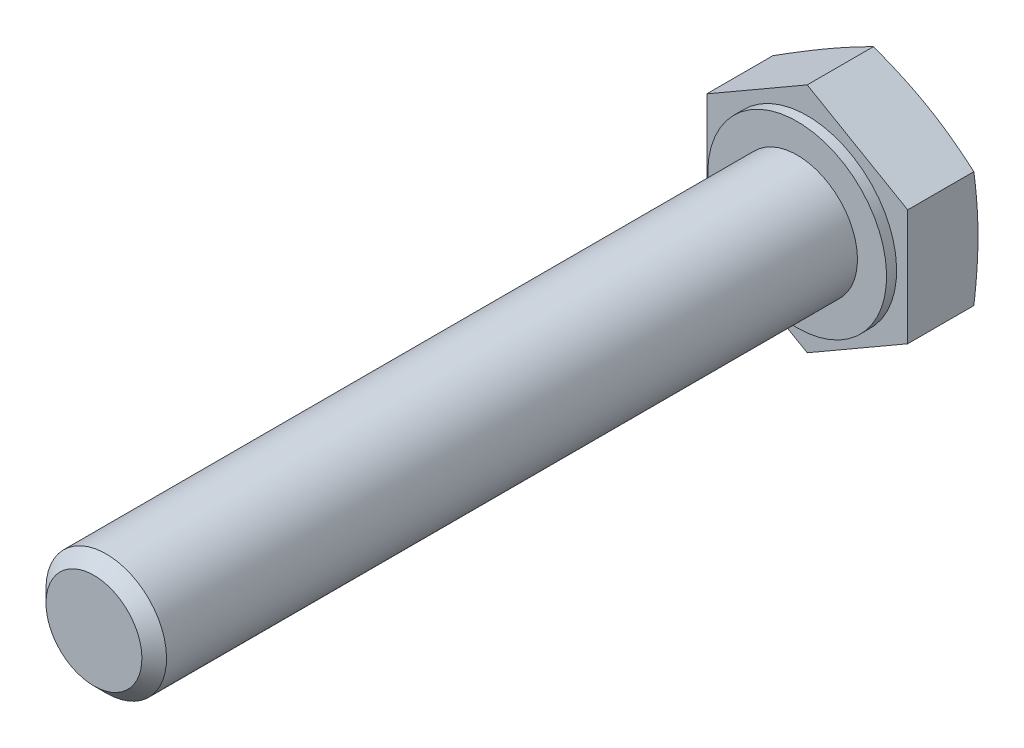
ISO-10303-21;
HEADER;
FILE_DESCRIPTION(('STEP AP214'),'2;1');
FILE_NAME('part.step','',(''),(''),'','','');
FILE_SCHEMA(('AUTOMOTIVE_DESIGN { 1 0 10303 214 1 1 1 1 }'));
ENDSEC;
DATA;
#1=APPLICATION_CONTEXT('core data for automotive mechanical design processes');
#2=APPLICATION_PROTOCOL_DEFINITION('international standard','automotive_design',2000,#1);
#3=PRODUCT_CONTEXT('',#1,'mechanical');
#4=PRODUCT('Part','Part','',(#3));
#5=PRODUCT_RELATED_PRODUCT_CATEGORY('part','',(#4));
#6=PRODUCT_DEFINITION_FORMATION('','',#4);
#7=PRODUCT_DEFINITION_CONTEXT('part definition',#1,'design');
#8=PRODUCT_DEFINITION('design','',#6,#7);
#9=PRODUCT_DEFINITION_SHAPE('','',#8);
#10=(LENGTH_UNIT() NAMED_UNIT(*) SI_UNIT(.MILLI.,.METRE.));
#11=(NAMED_UNIT(*) PLANE_ANGLE_UNIT() SI_UNIT($,.RADIAN.));
#12=(NAMED_UNIT(*) SI_UNIT($,.STERADIAN.) SOLID_ANGLE_UNIT());
#13=UNCERTAINTY_MEASURE_WITH_UNIT(LENGTH_MEASURE(1.E-05),#10,'distance_accuracy_value','');
#14=(GEOMETRIC_REPRESENTATION_CONTEXT(3) GLOBAL_UNCERTAINTY_ASSIGNED_CONTEXT((#13)) GLOBAL_UNIT_ASSIGNED_CONTEXT((#10,
#11,#12)) REPRESENTATION_CONTEXT('',''));
#15=CARTESIAN_POINT('',(0.,0.,0.));
#16=DIRECTION('',(0.,0.,1.));
#17=DIRECTION('',(1.,0.,0.));
#18=AXIS2_PLACEMENT_3D('',#15,#16,#17);
#19=CARTESIAN_POINT('',(0.,9.,3.5));
#20=DIRECTION('',(0.,0.,1.));
#21=DIRECTION('',(0.,1.,0.));
#22=AXIS2_PLACEMENT_3D('',#19,#20,#21);
#23=PLANE('',#22);
#24=CARTESIAN_POINT('',(0.,0.,3.5));
#25=DIRECTION('',(0.,0.,-1.));
#26=DIRECTION('',(0.,-1.,0.));
#27=AXIS2_PLACEMENT_3D('',#24,#25,#26);
#28=CIRCLE('',#27,4.45);
#29=CARTESIAN_POINT('',(0.,-4.45,3.5));
#30=VERTEX_POINT('',#29);
#31=EDGE_CURVE('E159',#30,#30,#28,.T.);
#32=ORIENTED_EDGE('',*,*,#31,.T.);
#33=EDGE_LOOP('',(#32));
#34=FACE_BOUND('',#33,.T.);
#35=DIRECTION('',(0.,-1.,0.));
#36=VECTOR('',#35,1.);
#37=CARTESIAN_POINT('',(-5.,9.,3.5));
#38=LINE('',#37,#36);
#39=CARTESIAN_POINT('',(-5.,2.8867513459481,3.5));
#40=VERTEX_POINT('',#39);
#41=CARTESIAN_POINT('',(-5.,-2.8867513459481,3.5));
#42=VERTEX_POINT('',#41);
#43=EDGE_CURVE('E161',#40,#42,#38,.T.);
#44=ORIENTED_EDGE('',*,*,#43,.T.);
#45=DIRECTION('',(0.866025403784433,-0.500000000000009,0.));
#46=VECTOR('',#45,1.);
#47=CARTESIAN_POINT('',(-6.39711431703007,-2.08012701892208,3.5));
#48=LINE('',#47,#46);
#49=CARTESIAN_POINT('',(0.,-5.7735026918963,3.5));
#50=VERTEX_POINT('',#49);
#51=EDGE_CURVE('E9',#42,#50,#48,.T.);
#52=ORIENTED_EDGE('',*,*,#51,.T.);
#53=DIRECTION('',(0.866025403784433,0.500000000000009,0.));
#54=VECTOR('',#53,1.);
#55=CARTESIAN_POINT('',(6.39711431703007,-2.08012701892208,3.5));
#56=LINE('',#55,#54);
#57=CARTESIAN_POINT('',(5.,-2.8867513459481,3.5));
#58=VERTEX_POINT('',#57);
#59=EDGE_CURVE('E22',#50,#58,#56,.T.);
#60=ORIENTED_EDGE('',*,*,#59,.T.);
#61=DIRECTION('',(0.,1.,0.));
#62=VECTOR('',#61,1.);
#63=CARTESIAN_POINT('',(5.,9.,3.5));
#64=LINE('',#63,#62);
#65=CARTESIAN_POINT('',(5.,2.8867513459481,3.5));
#66=VERTEX_POINT('',#65);
#67=EDGE_CURVE('E174',#58,#66,#64,.T.);
#68=ORIENTED_EDGE('',*,*,#67,.T.);
#69=DIRECTION('',(-0.866025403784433,0.500000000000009,0.));
#70=VECTOR('',#69,1.);
#71=CARTESIAN_POINT('',(-1.39711431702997,6.58012701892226,3.5));
#72=LINE('',#71,#70);
#73=CARTESIAN_POINT('',(0.,5.7735026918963,3.5));
#74=VERTEX_POINT('',#73);
#75=EDGE_CURVE('E166',#66,#74,#72,.T.);
#76=ORIENTED_EDGE('',*,*,#75,.T.);
#77=DIRECTION('',(-0.866025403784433,-0.500000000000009,0.));
#78=VECTOR('',#77,1.);
#79=CARTESIAN_POINT('',(1.39711431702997,6.58012701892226,3.5));
#80=LINE('',#79,#78);
#81=EDGE_CURVE('E164',#74,#40,#80,.T.);
#82=ORIENTED_EDGE('',*,*,#81,.T.);
#83=EDGE_LOOP('',(#44,#52,#60,#68,#76,#82));
#84=FACE_BOUND('',#83,.T.);
#85=ADVANCED_FACE('F14',(#34,#84),#23,.T.);
#86=CARTESIAN_POINT('',(0.,0.,39.));
#87=DIRECTION('',(0.,0.,-1.));
#88=DIRECTION('',(0.,-1.,0.));
#89=AXIS2_PLACEMENT_3D('',#86,#87,#88);
#90=CYLINDRICAL_SURFACE('',#89,4.45);
#91=CARTESIAN_POINT('',(0.,0.,4.));
#92=DIRECTION('',(0.,0.,-1.));
#93=DIRECTION('',(0.,-1.,0.));
#94=AXIS2_PLACEMENT_3D('',#91,#92,#93);
#95=CIRCLE('',#94,4.45);
#96=CARTESIAN_POINT('',(0.,-4.45,4.));
#97=VERTEX_POINT('',#96);
#98=EDGE_CURVE('E252',#97,#97,#95,.T.);
#99=ORIENTED_EDGE('',*,*,#98,.T.);
#100=EDGE_LOOP('',(#99));
#101=FACE_BOUND('',#100,.T.);
#102=ORIENTED_EDGE('',*,*,#31,.F.);
#103=EDGE_LOOP('',(#102));
#104=FACE_BOUND('',#103,.T.);
#105=ADVANCED_FACE('F147',(#101,#104),#90,.T.);
#106=CARTESIAN_POINT('',(0.,4.45,4.));
#107=DIRECTION('',(0.,0.,1.));
#108=DIRECTION('',(0.,1.,0.));
#109=AXIS2_PLACEMENT_3D('',#106,#107,#108);
#110=PLANE('',#109);
#111=CARTESIAN_POINT('',(0.,0.,4.));
#112=DIRECTION('',(0.,0.,-1.));
#113=DIRECTION('',(0.,-1.,0.));
#114=AXIS2_PLACEMENT_3D('',#111,#112,#113);
#115=CIRCLE('',#114,3.);
#116=CARTESIAN_POINT('',(0.,-3.,4.));
#117=VERTEX_POINT('',#116);
#118=EDGE_CURVE('E254',#117,#117,#115,.T.);
#119=ORIENTED_EDGE('',*,*,#118,.T.);
#120=EDGE_LOOP('',(#119));
#121=FACE_BOUND('',#120,.T.);
#122=ORIENTED_EDGE('',*,*,#98,.F.);
#123=EDGE_LOOP('',(#122));
#124=FACE_BOUND('',#123,.T.);
#125=ADVANCED_FACE('F143',(#121,#124),#110,.T.);
#126=CARTESIAN_POINT('',(0.,0.,39.));
#127=DIRECTION('',(0.,0.,-1.));
#128=DIRECTION('',(0.,-1.,0.));
#129=AXIS2_PLACEMENT_3D('',#126,#127,#128);
#130=CYLINDRICAL_SURFACE('',#129,3.);
#131=CARTESIAN_POINT('',(0.,0.,38.3865));
#132=DIRECTION('',(0.,0.,-1.));
#133=DIRECTION('',(0.,-1.,0.));
#134=AXIS2_PLACEMENT_3D('',#131,#132,#133);
#135=CIRCLE('',#134,3.);
#136=CARTESIAN_POINT('',(0.,-3.,38.3865));
#137=VERTEX_POINT('',#136);
#138=EDGE_CURVE('E258',#137,#137,#135,.T.);
#139=ORIENTED_EDGE('',*,*,#138,.T.);
#140=EDGE_LOOP('',(#139));
#141=FACE_BOUND('',#140,.T.);
#142=ORIENTED_EDGE('',*,*,#118,.F.);
#143=EDGE_LOOP('',(#142));
#144=FACE_BOUND('',#143,.T.);
#145=ADVANCED_FACE('F139',(#141,#144),#130,.T.);
#146=CARTESIAN_POINT('',(0.,0.,38.3865));
#147=DIRECTION('',(0.,0.,-1.));
#148=DIRECTION('',(0.,-1.,0.));
#149=AXIS2_PLACEMENT_3D('',#146,#147,#148);
#150=CONICAL_SURFACE('',#149,3.,0.785398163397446);
#151=CARTESIAN_POINT('',(0.,0.,39.));
#152=DIRECTION('',(0.,0.,-1.));
#153=DIRECTION('',(0.,-1.,0.));
#154=AXIS2_PLACEMENT_3D('',#151,#152,#153);
#155=CIRCLE('',#154,2.3865);
#156=CARTESIAN_POINT('',(0.,-2.3865,39.));
#157=VERTEX_POINT('',#156);
#158=EDGE_CURVE('E105',#157,#157,#155,.T.);
#159=ORIENTED_EDGE('',*,*,#158,.T.);
#160=EDGE_LOOP('',(#159));
#161=FACE_BOUND('',#160,.T.);
#162=ORIENTED_EDGE('',*,*,#138,.F.);
#163=EDGE_LOOP('',(#162));
#164=FACE_BOUND('',#163,.T.);
#165=ADVANCED_FACE('F135',(#161,#164),#150,.T.);
#166=CARTESIAN_POINT('',(0.,2.3865,39.));
#167=DIRECTION('',(0.,0.,1.));
#168=DIRECTION('',(0.,1.,0.));
#169=AXIS2_PLACEMENT_3D('',#166,#167,#168);
#170=PLANE('',#169);
#171=ORIENTED_EDGE('',*,*,#158,.F.);
#172=EDGE_LOOP('',(#171));
#173=FACE_BOUND('',#172,.T.);
#174=ADVANCED_FACE('F130',(#173),#170,.T.);
#175=CARTESIAN_POINT('',(-5.,-2.8867513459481,0.));
#176=DIRECTION('',(-0.500000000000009,-0.866025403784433,0.));
#177=DIRECTION('',(0.866025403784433,-0.500000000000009,0.));
#178=AXIS2_PLACEMENT_3D('',#175,#176,#177);
#179=PLANE('',#178);
#180=DIRECTION('',(0.,0.,1.));
#181=VECTOR('',#180,1.);
#182=CARTESIAN_POINT('',(0.,-5.7735026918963,0.));
#183=LINE('',#182,#181);
#184=CARTESIAN_POINT('',(0.,-5.7735026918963,0.20725942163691));
#185=VERTEX_POINT('',#184);
#186=EDGE_CURVE('E179',#185,#50,#183,.T.);
#187=ORIENTED_EDGE('',*,*,#186,.T.);
#188=ORIENTED_EDGE('',*,*,#51,.F.);
#189=DIRECTION('',(0.,0.,1.));
#190=VECTOR('',#189,1.);
#191=CARTESIAN_POINT('',(-5.,-2.8867513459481,0.));
#192=LINE('',#191,#190);
#193=CARTESIAN_POINT('',(-5.,-2.8867513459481,0.207259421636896));
#194=VERTEX_POINT('',#193);
#195=EDGE_CURVE('E35',#194,#42,#192,.T.);
#196=ORIENTED_EDGE('',*,*,#195,.F.);
#197=CARTESIAN_POINT('',(0.000199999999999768,-5.77361816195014,0.20729036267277));
#198=CARTESIAN_POINT('',(-0.207454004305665,-5.65372906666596,0.175152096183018));
#199=CARTESIAN_POINT('',(-0.415484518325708,-5.53362259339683,0.14597581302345));
#200=CARTESIAN_POINT('',(-0.832280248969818,-5.29298546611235,0.0947157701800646));
#201=CARTESIAN_POINT('',(-1.04104572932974,-5.17245465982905,0.0726348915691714));
#202=CARTESIAN_POINT('',(-1.45804559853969,-4.93169967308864,0.0368547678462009));
#203=CARTESIAN_POINT('',(-1.66627716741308,-4.81147712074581,0.0231128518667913));
#204=CARTESIAN_POINT('',(-2.08300586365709,-4.57087869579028,0.00468634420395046));
#205=CARTESIAN_POINT('',(-2.29150293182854,-4.45050285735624,0.));
#206=CARTESIAN_POINT('',(-2.70849706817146,-4.20975118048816,0.));
#207=CARTESIAN_POINT('',(-2.91699413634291,-4.08937534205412,0.00468634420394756));
#208=CARTESIAN_POINT('',(-3.33372283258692,-3.84877691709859,0.0231128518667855));
#209=CARTESIAN_POINT('',(-3.54195440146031,-3.72855436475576,0.0368547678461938));
#210=CARTESIAN_POINT('',(-3.95895427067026,-3.48779937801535,0.0726348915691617));
#211=CARTESIAN_POINT('',(-4.16771975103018,-3.36726857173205,0.0947157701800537));
#212=CARTESIAN_POINT('',(-4.58451548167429,-3.12663144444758,0.145975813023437));
#213=CARTESIAN_POINT('',(-4.79254599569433,-3.00652497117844,0.175152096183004));
#214=CARTESIAN_POINT('',(-5.0002,-2.88663587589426,0.207290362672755));
#215=B_SPLINE_CURVE_WITH_KNOTS('',3,(#197,#198,#199,#200,#201,#202,#203,#204,#205,#206,#207,
#208,#209,#210,#211,#212,#213,#214),.UNSPECIFIED.,.F.,.F.,(4,2,2,2,2,2,2,2,4),(0.,
0.725805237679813,1.45190481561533,2.17425686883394,2.89646911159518,3.61868135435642,
4.34103340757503,5.06713298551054,5.79293822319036),.UNSPECIFIED.);
#216=CARTESIAN_POINT('',(-2.50000000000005,-4.33012701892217,0.));
#217=VERTEX_POINT('',#216);
#218=EDGE_CURVE('E95',#217,#194,#215,.T.);
#219=ORIENTED_EDGE('',*,*,#218,.F.);
#220=EDGE_CURVE('E102',#185,#217,#215,.T.);
#221=ORIENTED_EDGE('',*,*,#220,.F.);
#222=EDGE_LOOP('',(#187,#188,#196,#219,#221));
#223=FACE_BOUND('',#222,.T.);
#224=ADVANCED_FACE('F94',(#223),#179,.T.);
#225=CARTESIAN_POINT('',(0.,-5.7735026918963,0.));
#226=DIRECTION('',(0.500000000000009,-0.866025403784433,0.));
#227=DIRECTION('',(0.866025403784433,0.500000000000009,0.));
#228=AXIS2_PLACEMENT_3D('',#225,#226,#227);
#229=PLANE('',#228);
#230=DIRECTION('',(0.,0.,1.));
#231=VECTOR('',#230,1.);
#232=CARTESIAN_POINT('',(5.,-2.8867513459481,0.));
#233=LINE('',#232,#231);
#234=CARTESIAN_POINT('',(5.,-2.8867513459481,0.207259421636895));
#235=VERTEX_POINT('',#234);
#236=EDGE_CURVE('E182',#235,#58,#233,.T.);
#237=ORIENTED_EDGE('',*,*,#236,.T.);
#238=ORIENTED_EDGE('',*,*,#59,.F.);
#239=ORIENTED_EDGE('',*,*,#186,.F.);
#240=CARTESIAN_POINT('',(5.0002,-2.88663587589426,0.207290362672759));
#241=CARTESIAN_POINT('',(4.79254599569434,-3.00652497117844,0.175152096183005));
#242=CARTESIAN_POINT('',(4.58451548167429,-3.12663144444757,0.145975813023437));
#243=CARTESIAN_POINT('',(4.16771975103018,-3.36726857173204,0.0947157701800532));
#244=CARTESIAN_POINT('',(3.95895427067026,-3.48779937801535,0.0726348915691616));
#245=CARTESIAN_POINT('',(3.54195440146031,-3.72855436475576,0.036854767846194));
#246=CARTESIAN_POINT('',(3.33372283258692,-3.84877691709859,0.0231128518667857));
#247=CARTESIAN_POINT('',(2.91699413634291,-4.08937534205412,0.00468634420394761));
#248=CARTESIAN_POINT('',(2.70849706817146,-4.20975118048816,0.));
#249=CARTESIAN_POINT('',(2.29150293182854,-4.45050285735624,0.));
#250=CARTESIAN_POINT('',(2.08300586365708,-4.57087869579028,0.00468634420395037));
#251=CARTESIAN_POINT('',(1.66627716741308,-4.81147712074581,0.0231128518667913));
#252=CARTESIAN_POINT('',(1.45804559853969,-4.93169967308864,0.036854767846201));
#253=CARTESIAN_POINT('',(1.04104572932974,-5.17245465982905,0.0726348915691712));
#254=CARTESIAN_POINT('',(0.832280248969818,-5.29298546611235,0.0947157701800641));
#255=CARTESIAN_POINT('',(0.415484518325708,-5.53362259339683,0.14597581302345));
#256=CARTESIAN_POINT('',(0.207454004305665,-5.65372906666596,0.175152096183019));
#257=CARTESIAN_POINT('',(-0.000199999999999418,-5.77361816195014,0.207290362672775));
#258=B_SPLINE_CURVE_WITH_KNOTS('',3,(#240,#241,#242,#243,#244,#245,#246,#247,#248,#249,#250,
#251,#252,#253,#254,#255,#256,#257),.UNSPECIFIED.,.F.,.F.,(4,2,2,2,2,2,2,2,4),(0.,
0.725805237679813,1.45190481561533,2.17425686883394,2.89646911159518,3.61868135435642,
4.34103340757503,5.06713298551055,5.79293822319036),.UNSPECIFIED.);
#259=CARTESIAN_POINT('',(2.50000000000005,-4.33012701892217,0.));
#260=VERTEX_POINT('',#259);
#261=EDGE_CURVE('E107',#260,#185,#258,.T.);
#262=ORIENTED_EDGE('',*,*,#261,.F.);
#263=EDGE_CURVE('E103',#235,#260,#258,.T.);
#264=ORIENTED_EDGE('',*,*,#263,.F.);
#265=EDGE_LOOP('',(#237,#238,#239,#262,#264));
#266=FACE_BOUND('',#265,.T.);
#267=ADVANCED_FACE('F129',(#266),#229,.T.);
#268=CARTESIAN_POINT('',(5.,-2.8867513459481,0.));
#269=DIRECTION('',(1.,0.,0.));
#270=DIRECTION('',(0.,1.,0.));
#271=AXIS2_PLACEMENT_3D('',#268,#269,#270);
#272=PLANE('',#271);
#273=DIRECTION('',(0.,0.,1.));
#274=VECTOR('',#273,1.);
#275=CARTESIAN_POINT('',(5.,2.8867513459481,0.));
#276=LINE('',#275,#274);
#277=CARTESIAN_POINT('',(5.,2.8867513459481,0.207259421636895));
#278=VERTEX_POINT('',#277);
#279=EDGE_CURVE('E184',#278,#66,#276,.T.);
#280=ORIENTED_EDGE('',*,*,#279,.T.);
#281=ORIENTED_EDGE('',*,*,#67,.F.);
#282=ORIENTED_EDGE('',*,*,#236,.F.);
#283=CARTESIAN_POINT('',(5.,-7.69458269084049,1.11906718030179));
#284=CARTESIAN_POINT('',(5.,-7.46706820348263,1.06796278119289));
#285=CARTESIAN_POINT('',(5.,-7.23941300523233,1.0174737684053));
#286=CARTESIAN_POINT('',(5.,-6.78375194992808,0.918058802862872));
#287=CARTESIAN_POINT('',(5.,-6.55574607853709,0.869132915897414));
#288=CARTESIAN_POINT('',(5.,-6.09911882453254,0.773135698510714));
#289=CARTESIAN_POINT('',(5.,-5.87049706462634,0.726066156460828));
#290=CARTESIAN_POINT('',(5.,-5.41278187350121,0.634280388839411));
#291=CARTESIAN_POINT('',(5.,-5.18368844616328,0.58956414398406));
#292=CARTESIAN_POINT('',(5.,-4.72678727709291,0.503393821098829));
#293=CARTESIAN_POINT('',(5.,-4.498983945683,0.461916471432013));
#294=CARTESIAN_POINT('',(5.,-4.04275918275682,0.382519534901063));
#295=CARTESIAN_POINT('',(5.,-3.81433776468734,0.344599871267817));
#296=CARTESIAN_POINT('',(5.,-3.35682516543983,0.273159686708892));
#297=CARTESIAN_POINT('',(5.,-3.12773405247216,0.239638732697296));
#298=CARTESIAN_POINT('',(5.,-2.66882104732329,0.177973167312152));
#299=CARTESIAN_POINT('',(5.,-2.43899915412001,0.149828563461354));
#300=CARTESIAN_POINT('',(5.,-1.97600503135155,0.0996994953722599));
#301=CARTESIAN_POINT('',(5.,-1.74282462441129,0.0777894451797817));
#302=CARTESIAN_POINT('',(5.,-1.27586518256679,0.0416334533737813));
#303=CARTESIAN_POINT('',(5.,-1.0420861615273,0.0273873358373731));
#304=CARTESIAN_POINT('',(5.,-0.574271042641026,0.00738932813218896));
#305=CARTESIAN_POINT('',(5.,-0.340235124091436,0.00163332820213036));
#306=CARTESIAN_POINT('',(5.,0.127887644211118,-0.00102928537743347));
#307=CARTESIAN_POINT('',(5.,0.361974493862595,0.00206408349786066));
#308=CARTESIAN_POINT('',(5.,0.83074436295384,0.0169275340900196));
#309=CARTESIAN_POINT('',(5.,1.06542633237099,0.0287300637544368));
#310=CARTESIAN_POINT('',(5.,1.53424613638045,0.060333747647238));
#311=CARTESIAN_POINT('',(5.,1.76838395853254,0.080135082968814));
#312=CARTESIAN_POINT('',(5.,2.23611310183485,0.126721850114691));
#313=CARTESIAN_POINT('',(5.,2.46970394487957,0.153512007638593));
#314=CARTESIAN_POINT('',(5.,2.93613140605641,0.212943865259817));
#315=CARTESIAN_POINT('',(5.,3.16896802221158,0.245585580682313));
#316=CARTESIAN_POINT('',(5.,3.62734449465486,0.314669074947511));
#317=CARTESIAN_POINT('',(5.,3.85290465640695,0.350977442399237));
#318=CARTESIAN_POINT('',(5.,4.30340506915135,0.427273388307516));
#319=CARTESIAN_POINT('',(5.,4.52834530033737,0.467261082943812));
#320=CARTESIAN_POINT('',(5.,4.97769703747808,0.550216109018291));
#321=CARTESIAN_POINT('',(5.,5.20210848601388,0.593183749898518));
#322=CARTESIAN_POINT('',(5.,5.65045683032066,0.681533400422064));
#323=CARTESIAN_POINT('',(5.,5.8743937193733,0.726915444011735));
#324=CARTESIAN_POINT('',(5.,6.54572239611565,0.866005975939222));
#325=CARTESIAN_POINT('',(5.,6.99250822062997,0.962635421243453));
#326=CARTESIAN_POINT('',(5.,7.88487948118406,1.1610939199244));
#327=CARTESIAN_POINT('',(5.,8.33046499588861,1.26292262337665));
#328=CARTESIAN_POINT('',(5.,9.21619088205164,1.46913185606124));
#329=CARTESIAN_POINT('',(5.,9.65633994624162,1.57347514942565));
#330=CARTESIAN_POINT('',(5.,10.5360344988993,1.7847076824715));
#331=CARTESIAN_POINT('',(5.,10.9755799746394,1.89159697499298));
#332=CARTESIAN_POINT('',(5.,11.8536174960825,2.10709659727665));
#333=CARTESIAN_POINT('',(5.,12.2921101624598,2.21570440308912));
#334=CARTESIAN_POINT('',(5.,13.1687231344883,2.43434816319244));
#335=CARTESIAN_POINT('',(5.,13.6068434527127,2.54438406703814));
#336=CARTESIAN_POINT('',(5.,14.0448357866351,2.65492101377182));
#337=B_SPLINE_CURVE_WITH_KNOTS('',3,(#283,#284,#285,#286,#287,#288,#289,#290,#291,#292,#293,
#294,#295,#296,#297,#298,#299,#300,#301,#302,#303,#304,#305,#306,#307,#308,#309,#310,#311,#312,
#313,#314,#315,#316,#317,#318,#319,#320,#321,#322,#323,#324,#325,#326,#327,#328,#329,#330,#331,
#332,#333,#334,#335,#336),.UNSPECIFIED.,.F.,.F.,(4,2,2,2,2,2,2,2,2,2,2,2,2,2,2,2,2,2,2,2,2,2,2,
2,2,2,4),(0.,0.699552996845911,1.39913539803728,2.09937607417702,2.79961101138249,
3.49423412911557,4.18884225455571,4.88338193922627,5.57792259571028,6.28043519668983,
6.98293167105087,7.68508798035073,8.38724290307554,9.09202715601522,9.7968273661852,
10.5021053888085,11.2073852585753,11.8927397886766,12.5781159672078,13.2635634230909,
13.9490205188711,15.3203131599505,16.6915136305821,18.0485468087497,19.4056081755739,
20.7608336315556,22.1160113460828),.UNSPECIFIED.);
#338=CARTESIAN_POINT('',(5.,0.,0.));
#339=VERTEX_POINT('',#338);
#340=EDGE_CURVE('E220',#339,#235,#337,.F.);
#341=ORIENTED_EDGE('',*,*,#340,.F.);
#342=EDGE_CURVE('E226',#278,#339,#337,.F.);
#343=ORIENTED_EDGE('',*,*,#342,.F.);
#344=EDGE_LOOP('',(#280,#281,#282,#341,#343));
#345=FACE_BOUND('',#344,.T.);
#346=ADVANCED_FACE('F214',(#345),#272,.T.);
#347=CARTESIAN_POINT('',(5.,2.8867513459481,0.));
#348=DIRECTION('',(0.500000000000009,0.866025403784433,0.));
#349=DIRECTION('',(-0.866025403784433,0.500000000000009,0.));
#350=AXIS2_PLACEMENT_3D('',#347,#348,#349);
#351=PLANE('',#350);
#352=DIRECTION('',(0.,0.,1.));
#353=VECTOR('',#352,1.);
#354=CARTESIAN_POINT('',(0.,5.7735026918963,0.));
#355=LINE('',#354,#353);
#356=CARTESIAN_POINT('',(0.,5.7735026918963,0.207259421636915));
#357=VERTEX_POINT('',#356);
#358=EDGE_CURVE('E272',#357,#74,#355,.T.);
#359=ORIENTED_EDGE('',*,*,#358,.T.);
#360=ORIENTED_EDGE('',*,*,#75,.F.);
#361=ORIENTED_EDGE('',*,*,#279,.F.);
#362=CARTESIAN_POINT('',(-0.000200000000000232,5.77361816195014,0.207290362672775));
#363=CARTESIAN_POINT('',(0.207454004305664,5.65372906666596,0.17515209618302));
#364=CARTESIAN_POINT('',(0.415484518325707,5.53362259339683,0.145975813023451));
#365=CARTESIAN_POINT('',(0.832280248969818,5.29298546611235,0.0947157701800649));
#366=CARTESIAN_POINT('',(1.04104572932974,5.17245465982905,0.072634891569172));
#367=CARTESIAN_POINT('',(1.45804559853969,4.93169967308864,0.0368547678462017));
#368=CARTESIAN_POINT('',(1.66627716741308,4.81147712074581,0.0231128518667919));
#369=CARTESIAN_POINT('',(2.08300586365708,4.57087869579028,0.00468634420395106));
#370=CARTESIAN_POINT('',(2.29150293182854,4.45050285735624,0.));
#371=CARTESIAN_POINT('',(2.70849706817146,4.20975118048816,0.));
#372=CARTESIAN_POINT('',(2.91699413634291,4.08937534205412,0.00468634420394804));
#373=CARTESIAN_POINT('',(3.33372283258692,3.84877691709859,0.023112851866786));
#374=CARTESIAN_POINT('',(3.54195440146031,3.72855436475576,0.0368547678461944));
#375=CARTESIAN_POINT('',(3.95895427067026,3.48779937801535,0.0726348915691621));
#376=CARTESIAN_POINT('',(4.16771975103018,3.36726857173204,0.0947157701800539));
#377=CARTESIAN_POINT('',(4.58451548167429,3.12663144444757,0.145975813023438));
#378=CARTESIAN_POINT('',(4.79254599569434,3.00652497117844,0.175152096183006));
#379=CARTESIAN_POINT('',(5.0002,2.88663587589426,0.207290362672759));
#380=B_SPLINE_CURVE_WITH_KNOTS('',3,(#362,#363,#364,#365,#366,#367,#368,#369,#370,#371,#372,
#373,#374,#375,#376,#377,#378,#379),.UNSPECIFIED.,.F.,.F.,(4,2,2,2,2,2,2,2,4),(0.,
0.725805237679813,1.45190481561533,2.17425686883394,2.89646911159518,3.61868135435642,
4.34103340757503,5.06713298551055,5.79293822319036),.UNSPECIFIED.);
#381=CARTESIAN_POINT('',(2.50000000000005,4.33012701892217,0.));
#382=VERTEX_POINT('',#381);
#383=EDGE_CURVE('E200',#382,#278,#380,.T.);
#384=ORIENTED_EDGE('',*,*,#383,.F.);
#385=EDGE_CURVE('E227',#357,#382,#380,.T.);
#386=ORIENTED_EDGE('',*,*,#385,.F.);
#387=EDGE_LOOP('',(#359,#360,#361,#384,#386));
#388=FACE_BOUND('',#387,.T.);
#389=ADVANCED_FACE('F209',(#388),#351,.T.);
#390=CARTESIAN_POINT('',(0.,5.7735026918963,0.));
#391=DIRECTION('',(-0.500000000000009,0.866025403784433,0.));
#392=DIRECTION('',(-0.866025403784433,-0.500000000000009,0.));
#393=AXIS2_PLACEMENT_3D('',#390,#391,#392);
#394=PLANE('',#393);
#395=DIRECTION('',(0.,0.,1.));
#396=VECTOR('',#395,1.);
#397=CARTESIAN_POINT('',(-5.,2.8867513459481,0.));
#398=LINE('',#397,#396);
#399=CARTESIAN_POINT('',(-5.,2.8867513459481,0.207259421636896));
#400=VERTEX_POINT('',#399);
#401=EDGE_CURVE('E29',#400,#40,#398,.T.);
#402=ORIENTED_EDGE('',*,*,#401,.T.);
#403=ORIENTED_EDGE('',*,*,#81,.F.);
#404=ORIENTED_EDGE('',*,*,#358,.F.);
#405=CARTESIAN_POINT('',(-5.0002,2.88663587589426,0.20729036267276));
#406=CARTESIAN_POINT('',(-4.79254599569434,3.00652497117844,0.175152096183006));
#407=CARTESIAN_POINT('',(-4.58451548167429,3.12663144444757,0.145975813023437));
#408=CARTESIAN_POINT('',(-4.16771975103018,3.36726857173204,0.0947157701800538));
#409=CARTESIAN_POINT('',(-3.95895427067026,3.48779937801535,0.0726348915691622));
#410=CARTESIAN_POINT('',(-3.54195440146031,3.72855436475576,0.0368547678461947));
#411=CARTESIAN_POINT('',(-3.33372283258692,3.84877691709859,0.0231128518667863));
#412=CARTESIAN_POINT('',(-2.91699413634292,4.08937534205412,0.00468634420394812));
#413=CARTESIAN_POINT('',(-2.70849706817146,4.20975118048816,0.));
#414=CARTESIAN_POINT('',(-2.29150293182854,4.45050285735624,0.));
#415=CARTESIAN_POINT('',(-2.08300586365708,4.57087869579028,0.0046863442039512));
#416=CARTESIAN_POINT('',(-1.66627716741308,4.81147712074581,0.0231128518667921));
#417=CARTESIAN_POINT('',(-1.45804559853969,4.93169967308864,0.0368547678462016));
#418=CARTESIAN_POINT('',(-1.04104572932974,5.17245465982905,0.0726348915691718));
#419=CARTESIAN_POINT('',(-0.832280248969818,5.29298546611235,0.0947157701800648));
#420=CARTESIAN_POINT('',(-0.415484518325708,5.53362259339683,0.145975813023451));
#421=CARTESIAN_POINT('',(-0.207454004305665,5.65372906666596,0.17515209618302));
#422=CARTESIAN_POINT('',(0.00019999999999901,5.77361816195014,0.207290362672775));
#423=B_SPLINE_CURVE_WITH_KNOTS('',3,(#405,#406,#407,#408,#409,#410,#411,#412,#413,#414,#415,
#416,#417,#418,#419,#420,#421,#422),.UNSPECIFIED.,.F.,.F.,(4,2,2,2,2,2,2,2,4),(0.,
0.725805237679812,1.45190481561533,2.17425686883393,2.89646911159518,3.61868135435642,
4.34103340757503,5.06713298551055,5.79293822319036),.UNSPECIFIED.);
#424=CARTESIAN_POINT('',(-2.50000000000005,4.33012701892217,0.));
#425=VERTEX_POINT('',#424);
#426=EDGE_CURVE('E90',#425,#357,#423,.T.);
#427=ORIENTED_EDGE('',*,*,#426,.F.);
#428=EDGE_CURVE('E199',#400,#425,#423,.T.);
#429=ORIENTED_EDGE('',*,*,#428,.F.);
#430=EDGE_LOOP('',(#402,#403,#404,#427,#429));
#431=FACE_BOUND('',#430,.T.);
#432=ADVANCED_FACE('F206',(#431),#394,.T.);
#433=CARTESIAN_POINT('',(-5.,2.8867513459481,0.));
#434=DIRECTION('',(-1.,0.,0.));
#435=DIRECTION('',(0.,-1.,0.));
#436=AXIS2_PLACEMENT_3D('',#433,#434,#435);
#437=PLANE('',#436);
#438=ORIENTED_EDGE('',*,*,#195,.T.);
#439=ORIENTED_EDGE('',*,*,#43,.F.);
#440=ORIENTED_EDGE('',*,*,#401,.F.);
#441=CARTESIAN_POINT('',(-5.,-7.69458269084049,1.11906718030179));
#442=CARTESIAN_POINT('',(-5.,-7.46706820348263,1.06796278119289));
#443=CARTESIAN_POINT('',(-5.,-7.23941300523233,1.0174737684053));
#444=CARTESIAN_POINT('',(-5.,-6.78375194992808,0.918058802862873));
#445=CARTESIAN_POINT('',(-5.,-6.55574607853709,0.869132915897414));
#446=CARTESIAN_POINT('',(-5.,-6.09911882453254,0.773135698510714));
#447=CARTESIAN_POINT('',(-5.,-5.87049706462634,0.726066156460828));
#448=CARTESIAN_POINT('',(-5.,-5.41278187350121,0.634280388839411));
#449=CARTESIAN_POINT('',(-5.,-5.18368844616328,0.58956414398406));
#450=CARTESIAN_POINT('',(-5.,-4.72678727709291,0.503393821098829));
#451=CARTESIAN_POINT('',(-5.,-4.498983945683,0.461916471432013));
#452=CARTESIAN_POINT('',(-5.,-4.04275918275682,0.382519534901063));
#453=CARTESIAN_POINT('',(-5.,-3.81433776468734,0.344599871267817));
#454=CARTESIAN_POINT('',(-5.,-3.35682516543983,0.273159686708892));
#455=CARTESIAN_POINT('',(-5.,-3.12773405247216,0.239638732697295));
#456=CARTESIAN_POINT('',(-5.,-2.66882104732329,0.177973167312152));
#457=CARTESIAN_POINT('',(-5.,-2.43899915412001,0.149828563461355));
#458=CARTESIAN_POINT('',(-5.,-1.97600503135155,0.0996994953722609));
#459=CARTESIAN_POINT('',(-5.,-1.74282462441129,0.077789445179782));
#460=CARTESIAN_POINT('',(-5.,-1.27586518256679,0.0416334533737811));
#461=CARTESIAN_POINT('',(-5.,-1.0420861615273,0.027387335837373));
#462=CARTESIAN_POINT('',(-5.,-0.574271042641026,0.00738932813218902));
#463=CARTESIAN_POINT('',(-5.,-0.340235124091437,0.00163332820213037));
#464=CARTESIAN_POINT('',(-5.,0.127887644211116,-0.00102928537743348));
#465=CARTESIAN_POINT('',(-5.,0.361974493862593,0.00206408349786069));
#466=CARTESIAN_POINT('',(-5.,0.830744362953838,0.0169275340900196));
#467=CARTESIAN_POINT('',(-5.,1.06542633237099,0.0287300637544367));
#468=CARTESIAN_POINT('',(-5.,1.53424613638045,0.0603337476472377));
#469=CARTESIAN_POINT('',(-5.,1.76838395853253,0.0801350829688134));
#470=CARTESIAN_POINT('',(-5.,2.23611310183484,0.126721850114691));
#471=CARTESIAN_POINT('',(-5.,2.46970394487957,0.153512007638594));
#472=CARTESIAN_POINT('',(-5.,2.9361314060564,0.212943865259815));
#473=CARTESIAN_POINT('',(-5.,3.16896802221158,0.245585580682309));
#474=CARTESIAN_POINT('',(-5.,3.62734449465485,0.314669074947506));
#475=CARTESIAN_POINT('',(-5.,3.85290465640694,0.350977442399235));
#476=CARTESIAN_POINT('',(-5.,4.30340506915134,0.427273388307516));
#477=CARTESIAN_POINT('',(-5.,4.52834530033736,0.467261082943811));
#478=CARTESIAN_POINT('',(-5.,4.97769703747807,0.55021610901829));
#479=CARTESIAN_POINT('',(-5.,5.20210848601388,0.593183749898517));
#480=CARTESIAN_POINT('',(-5.,5.65045683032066,0.681533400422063));
#481=CARTESIAN_POINT('',(-5.,5.87439371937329,0.726915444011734));
#482=CARTESIAN_POINT('',(-5.,6.54572239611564,0.866005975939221));
#483=CARTESIAN_POINT('',(-5.,6.99250822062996,0.962635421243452));
#484=CARTESIAN_POINT('',(-5.,7.88487948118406,1.1610939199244));
#485=CARTESIAN_POINT('',(-5.,8.33046499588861,1.26292262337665));
#486=CARTESIAN_POINT('',(-5.,9.21619088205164,1.46913185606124));
#487=CARTESIAN_POINT('',(-5.,9.65633994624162,1.57347514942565));
#488=CARTESIAN_POINT('',(-5.,10.5360344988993,1.7847076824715));
#489=CARTESIAN_POINT('',(-5.,10.9755799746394,1.89159697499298));
#490=CARTESIAN_POINT('',(-5.,11.8536174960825,2.10709659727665));
#491=CARTESIAN_POINT('',(-5.,12.2921101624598,2.21570440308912));
#492=CARTESIAN_POINT('',(-5.,13.1687231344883,2.43434816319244));
#493=CARTESIAN_POINT('',(-5.,13.6068434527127,2.54438406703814));
#494=CARTESIAN_POINT('',(-5.,14.0448357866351,2.65492101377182));
#495=B_SPLINE_CURVE_WITH_KNOTS('',3,(#441,#442,#443,#444,#445,#446,#447,#448,#449,#450,#451,
#452,#453,#454,#455,#456,#457,#458,#459,#460,#461,#462,#463,#464,#465,#466,#467,#468,#469,#470,
#471,#472,#473,#474,#475,#476,#477,#478,#479,#480,#481,#482,#483,#484,#485,#486,#487,#488,#489,
#490,#491,#492,#493,#494),.UNSPECIFIED.,.F.,.F.,(4,2,2,2,2,2,2,2,2,2,2,2,2,2,2,2,2,2,2,2,2,2,2,
2,2,2,4),(0.,0.699552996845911,1.39913539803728,2.09937607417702,2.79961101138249,
3.49423412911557,4.18884225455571,4.88338193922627,5.57792259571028,6.28043519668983,
6.98293167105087,7.68508798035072,8.38724290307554,9.09202715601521,9.79682736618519,
10.5021053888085,11.2073852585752,11.8927397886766,12.5781159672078,13.2635634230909,
13.949020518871,15.3203131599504,16.6915136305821,18.0485468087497,19.4056081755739,
20.7608336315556,22.1160113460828),.UNSPECIFIED.);
#496=CARTESIAN_POINT('',(-5.,0.,0.));
#497=VERTEX_POINT('',#496);
#498=EDGE_CURVE('E85',#497,#400,#495,.T.);
#499=ORIENTED_EDGE('',*,*,#498,.F.);
#500=EDGE_CURVE('E82',#194,#497,#495,.T.);
#501=ORIENTED_EDGE('',*,*,#500,.F.);
#502=EDGE_LOOP('',(#438,#439,#440,#499,#501));
#503=FACE_BOUND('',#502,.T.);
#504=ADVANCED_FACE('F83',(#503),#437,.T.);
#505=CARTESIAN_POINT('',(0.,0.,0.));
#506=DIRECTION('',(0.,0.,1.));
#507=DIRECTION('',(0.,1.,0.));
#508=AXIS2_PLACEMENT_3D('',#505,#506,#507);
#509=CONICAL_SURFACE('',#508,5.,1.30899693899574);
#510=CARTESIAN_POINT('',(0.,0.,0.));
#511=DIRECTION('',(0.,0.,-1.));
#512=DIRECTION('',(0.,-1.,0.));
#513=AXIS2_PLACEMENT_3D('',#510,#511,#512);
#514=CIRCLE('',#513,5.);
#515=EDGE_CURVE('E170',#260,#217,#514,.T.);
#516=ORIENTED_EDGE('',*,*,#515,.F.);
#517=ORIENTED_EDGE('',*,*,#261,.T.);
#518=ORIENTED_EDGE('',*,*,#220,.T.);
#519=EDGE_LOOP('',(#516,#517,#518));
#520=FACE_BOUND('',#519,.T.);
#521=ADVANCED_FACE('F276',(#520),#509,.T.);
#522=EDGE_CURVE('E250',#339,#260,#514,.T.);
#523=ORIENTED_EDGE('',*,*,#522,.F.);
#524=ORIENTED_EDGE('',*,*,#340,.T.);
#525=ORIENTED_EDGE('',*,*,#263,.T.);
#526=EDGE_LOOP('',(#523,#524,#525));
#527=FACE_BOUND('',#526,.T.);
#528=ADVANCED_FACE('F271',(#527),#509,.T.);
#529=ORIENTED_EDGE('',*,*,#383,.T.);
#530=ORIENTED_EDGE('',*,*,#342,.T.);
#531=EDGE_CURVE('E246',#382,#339,#514,.T.);
#532=ORIENTED_EDGE('',*,*,#531,.F.);
#533=EDGE_LOOP('',(#529,#530,#532));
#534=FACE_BOUND('',#533,.T.);
#535=ADVANCED_FACE('F122',(#534),#509,.T.);
#536=ORIENTED_EDGE('',*,*,#426,.T.);
#537=ORIENTED_EDGE('',*,*,#385,.T.);
#538=EDGE_CURVE('E242',#425,#382,#514,.T.);
#539=ORIENTED_EDGE('',*,*,#538,.F.);
#540=EDGE_LOOP('',(#536,#537,#539));
#541=FACE_BOUND('',#540,.T.);
#542=ADVANCED_FACE('F243',(#541),#509,.T.);
#543=EDGE_CURVE('E101',#217,#497,#514,.T.);
#544=ORIENTED_EDGE('',*,*,#543,.F.);
#545=ORIENTED_EDGE('',*,*,#218,.T.);
#546=ORIENTED_EDGE('',*,*,#500,.T.);
#547=EDGE_LOOP('',(#544,#545,#546));
#548=FACE_BOUND('',#547,.T.);
#549=ADVANCED_FACE('F99',(#548),#509,.T.);
#550=CARTESIAN_POINT('',(0.,0.,0.));
#551=DIRECTION('',(0.,0.,-1.));
#552=DIRECTION('',(0.,-1.,0.));
#553=AXIS2_PLACEMENT_3D('',#550,#551,#552);
#554=PLANE('',#553);
#555=ORIENTED_EDGE('',*,*,#543,.T.);
#556=EDGE_CURVE('E168',#497,#425,#514,.T.);
#557=ORIENTED_EDGE('',*,*,#556,.T.);
#558=ORIENTED_EDGE('',*,*,#538,.T.);
#559=ORIENTED_EDGE('',*,*,#531,.T.);
#560=ORIENTED_EDGE('',*,*,#522,.T.);
#561=ORIENTED_EDGE('',*,*,#515,.T.);
#562=EDGE_LOOP('',(#555,#557,#558,#559,#560,#561));
#563=FACE_BOUND('',#562,.T.);
#564=ADVANCED_FACE('F16',(#563),#554,.T.);
#565=ORIENTED_EDGE('',*,*,#498,.T.);
#566=ORIENTED_EDGE('',*,*,#428,.T.);
#567=ORIENTED_EDGE('',*,*,#556,.F.);
#568=EDGE_LOOP('',(#565,#566,#567));
#569=FACE_BOUND('',#568,.T.);
#570=ADVANCED_FACE('F239',(#569),#509,.T.);
#571=CLOSED_SHELL('',(#85,#105,#125,#145,#165,#174,#224,#267,#346,#389,#432,#504,#521,#528,#535,
#542,#549,#564,#570));
#572=MANIFOLD_SOLID_BREP('B1',#571);
#573=ADVANCED_BREP_SHAPE_REPRESENTATION('',(#18,#572),#14);
#574=SHAPE_DEFINITION_REPRESENTATION(#9,#573);
ENDSEC;
END-ISO-10303-21;
